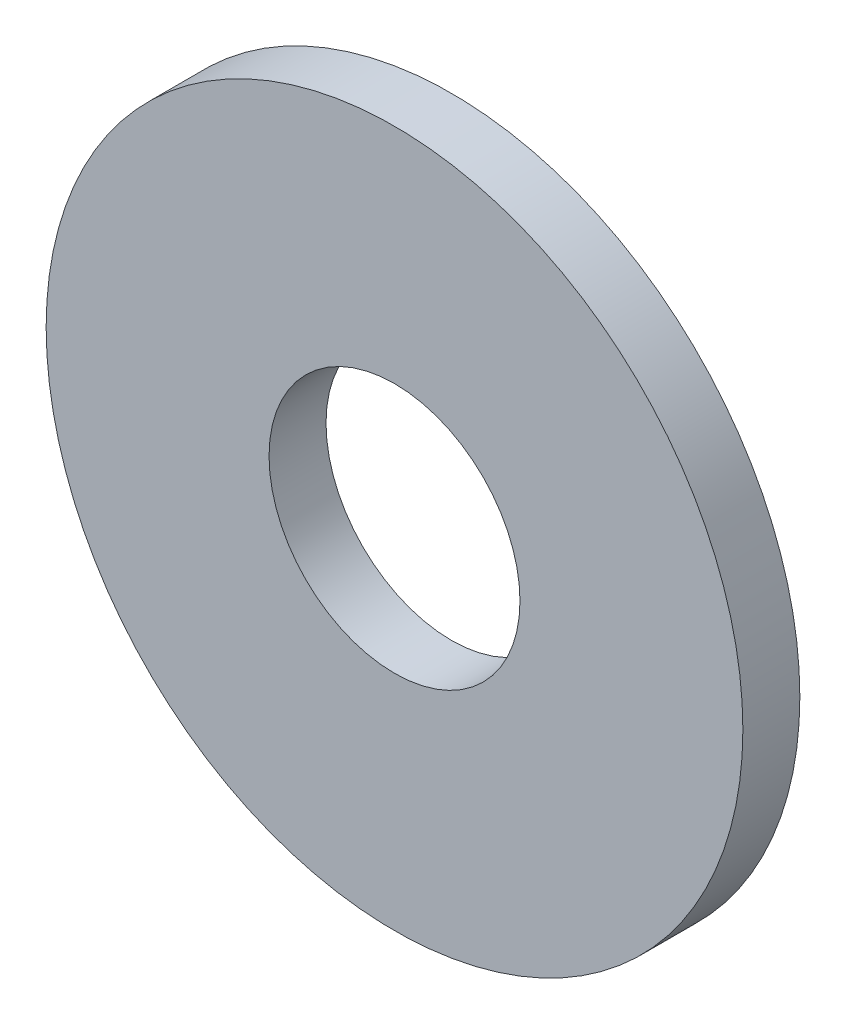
from build123d import *

# Parameters (mm, degrees)
SKETCH1_R           = 11.8
SKETCH1_R_2         = 4.25
BOSS_EXTRUDE2_DEPTH = 1.93


with BuildPart() as part:
    # Sketch1 → Boss-Extrude2 (new body)
    with BuildSketch(Plane.XY):
        Circle(SKETCH1_R)
        Circle(SKETCH1_R_2, mode=Mode.SUBTRACT)
    extrude(amount=BOSS_EXTRUDE2_DEPTH)


solid = part.part
